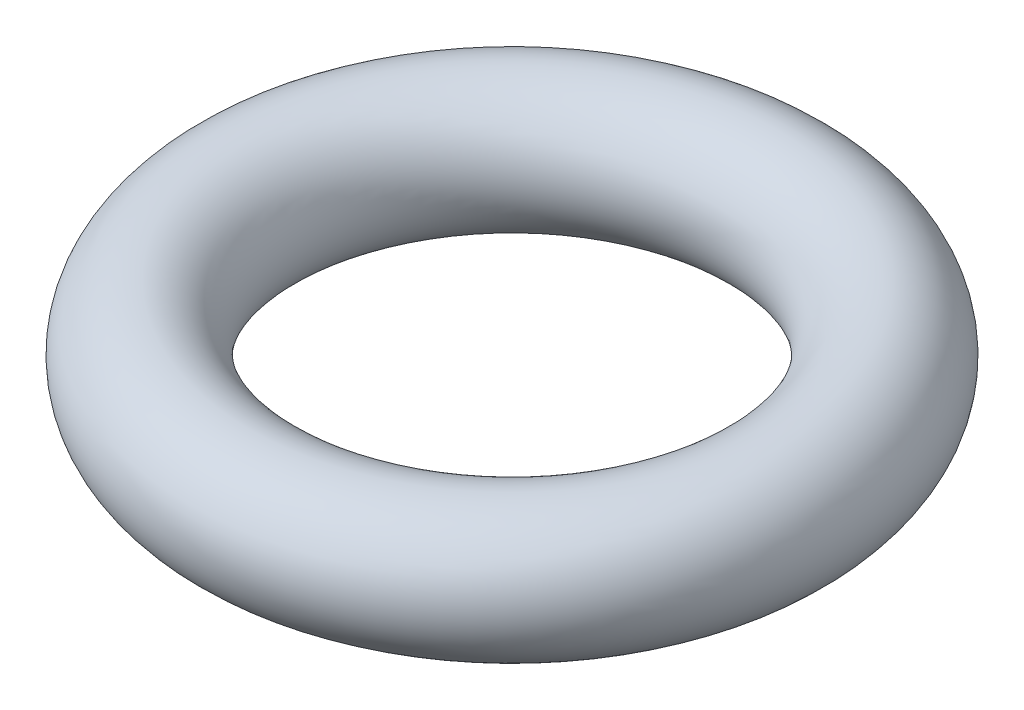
ISO-10303-21;
HEADER;
FILE_DESCRIPTION(('STEP AP214'),'2;1');
FILE_NAME('part.step','',(''),(''),'','','');
FILE_SCHEMA(('AUTOMOTIVE_DESIGN { 1 0 10303 214 1 1 1 1 }'));
ENDSEC;
DATA;
#1=APPLICATION_CONTEXT('core data for automotive mechanical design processes');
#2=APPLICATION_PROTOCOL_DEFINITION('international standard','automotive_design',2000,#1);
#3=PRODUCT_CONTEXT('',#1,'mechanical');
#4=PRODUCT('Part','Part','',(#3));
#5=PRODUCT_RELATED_PRODUCT_CATEGORY('part','',(#4));
#6=PRODUCT_DEFINITION_FORMATION('','',#4);
#7=PRODUCT_DEFINITION_CONTEXT('part definition',#1,'design');
#8=PRODUCT_DEFINITION('design','',#6,#7);
#9=PRODUCT_DEFINITION_SHAPE('','',#8);
#10=(LENGTH_UNIT() NAMED_UNIT(*) SI_UNIT(.MILLI.,.METRE.));
#11=(NAMED_UNIT(*) PLANE_ANGLE_UNIT() SI_UNIT($,.RADIAN.));
#12=(NAMED_UNIT(*) SI_UNIT($,.STERADIAN.) SOLID_ANGLE_UNIT());
#13=UNCERTAINTY_MEASURE_WITH_UNIT(LENGTH_MEASURE(1.E-05),#10,'distance_accuracy_value','');
#14=(GEOMETRIC_REPRESENTATION_CONTEXT(3) GLOBAL_UNCERTAINTY_ASSIGNED_CONTEXT((#13)) GLOBAL_UNIT_ASSIGNED_CONTEXT((#10,
#11,#12)) REPRESENTATION_CONTEXT('',''));
#15=CARTESIAN_POINT('',(0.,0.,0.));
#16=DIRECTION('',(0.,0.,1.));
#17=DIRECTION('',(1.,0.,0.));
#18=AXIS2_PLACEMENT_3D('',#15,#16,#17);
#19=CARTESIAN_POINT('',(0.,0.,0.));
#20=DIRECTION('',(0.,-1.,0.));
#21=DIRECTION('',(0.,0.,-1.));
#22=AXIS2_PLACEMENT_3D('',#19,#20,#21);
#23=TOROIDAL_SURFACE('',#22,3.,0.75);
#24=CARTESIAN_POINT('',(0.,0.,-3.75));
#25=VERTEX_POINT('',#24);
#26=VERTEX_LOOP('',#25);
#27=FACE_BOUND('',#26,.T.);
#28=ADVANCED_FACE('F29',(#27),#23,.T.);
#29=CLOSED_SHELL('',(#28));
#30=MANIFOLD_SOLID_BREP('B2',#29);
#31=ADVANCED_BREP_SHAPE_REPRESENTATION('',(#18,#30),#14);
#32=SHAPE_DEFINITION_REPRESENTATION(#9,#31);
ENDSEC;
END-ISO-10303-21;
